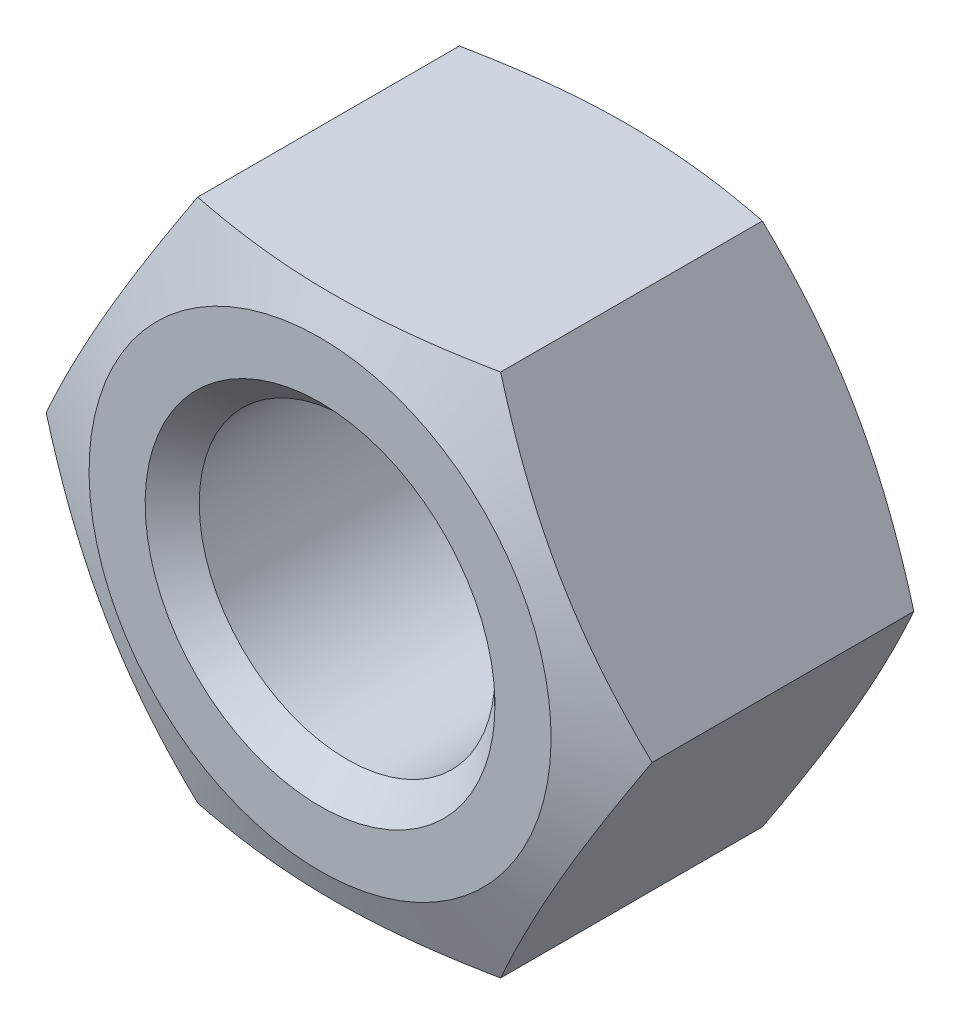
ISO-10303-21;
HEADER;
FILE_DESCRIPTION(('STEP AP214'),'2;1');
FILE_NAME('part.step','',(''),(''),'','','');
FILE_SCHEMA(('AUTOMOTIVE_DESIGN { 1 0 10303 214 1 1 1 1 }'));
ENDSEC;
DATA;
#1=APPLICATION_CONTEXT('core data for automotive mechanical design processes');
#2=APPLICATION_PROTOCOL_DEFINITION('international standard','automotive_design',2000,#1);
#3=PRODUCT_CONTEXT('',#1,'mechanical');
#4=PRODUCT('Part','Part','',(#3));
#5=PRODUCT_RELATED_PRODUCT_CATEGORY('part','',(#4));
#6=PRODUCT_DEFINITION_FORMATION('','',#4);
#7=PRODUCT_DEFINITION_CONTEXT('part definition',#1,'design');
#8=PRODUCT_DEFINITION('design','',#6,#7);
#9=PRODUCT_DEFINITION_SHAPE('','',#8);
#10=(LENGTH_UNIT() NAMED_UNIT(*) SI_UNIT(.MILLI.,.METRE.));
#11=(NAMED_UNIT(*) PLANE_ANGLE_UNIT() SI_UNIT($,.RADIAN.));
#12=(NAMED_UNIT(*) SI_UNIT($,.STERADIAN.) SOLID_ANGLE_UNIT());
#13=UNCERTAINTY_MEASURE_WITH_UNIT(LENGTH_MEASURE(1.E-05),#10,'distance_accuracy_value','');
#14=(GEOMETRIC_REPRESENTATION_CONTEXT(3) GLOBAL_UNCERTAINTY_ASSIGNED_CONTEXT((#13)) GLOBAL_UNIT_ASSIGNED_CONTEXT((#10,
#11,#12)) REPRESENTATION_CONTEXT('',''));
#15=CARTESIAN_POINT('',(0.,0.,0.));
#16=DIRECTION('',(0.,0.,1.));
#17=DIRECTION('',(1.,0.,0.));
#18=AXIS2_PLACEMENT_3D('',#15,#16,#17);
#19=CARTESIAN_POINT('',(12.12435,0.,12.8));
#20=DIRECTION('',(0.,0.,1.));
#21=DIRECTION('',(1.,0.,0.));
#22=AXIS2_PLACEMENT_3D('',#19,#20,#21);
#23=PLANE('',#22);
#24=CARTESIAN_POINT('',(0.,0.,12.8));
#25=DIRECTION('',(0.,0.,-1.));
#26=DIRECTION('',(0.,1.,0.));
#27=AXIS2_PLACEMENT_3D('',#24,#25,#26);
#28=CIRCLE('',#27,7.);
#29=CARTESIAN_POINT('',(0.,7.,12.8));
#30=VERTEX_POINT('',#29);
#31=EDGE_CURVE('E208',#30,#30,#28,.T.);
#32=ORIENTED_EDGE('',*,*,#31,.T.);
#33=EDGE_LOOP('',(#32));
#34=FACE_BOUND('',#33,.T.);
#35=CARTESIAN_POINT('',(0.,0.,12.8));
#36=DIRECTION('',(0.,0.,-1.));
#37=DIRECTION('',(0.,1.,0.));
#38=AXIS2_PLACEMENT_3D('',#35,#36,#37);
#39=CIRCLE('',#38,9.24424893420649);
#40=CARTESIAN_POINT('',(0.,9.24424893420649,12.8));
#41=VERTEX_POINT('',#40);
#42=EDGE_CURVE('E211',#41,#41,#39,.T.);
#43=ORIENTED_EDGE('',*,*,#42,.F.);
#44=EDGE_LOOP('',(#43));
#45=FACE_BOUND('',#44,.T.);
#46=ADVANCED_FACE('F17',(#34,#45),#23,.T.);
#47=CARTESIAN_POINT('',(0.,0.,12.8));
#48=DIRECTION('',(0.,0.,1.));
#49=DIRECTION('',(0.,-1.,0.));
#50=AXIS2_PLACEMENT_3D('',#47,#48,#49);
#51=CONICAL_SURFACE('',#50,7.,0.785398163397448);
#52=CARTESIAN_POINT('',(0.,0.,11.7175));
#53=DIRECTION('',(0.,0.,-1.));
#54=DIRECTION('',(0.,1.,0.));
#55=AXIS2_PLACEMENT_3D('',#52,#53,#54);
#56=CIRCLE('',#55,5.9175);
#57=CARTESIAN_POINT('',(0.,5.9175,11.7175));
#58=VERTEX_POINT('',#57);
#59=EDGE_CURVE('E98',#58,#58,#56,.T.);
#60=ORIENTED_EDGE('',*,*,#59,.T.);
#61=EDGE_LOOP('',(#60));
#62=FACE_BOUND('',#61,.T.);
#63=ORIENTED_EDGE('',*,*,#31,.F.);
#64=EDGE_LOOP('',(#63));
#65=FACE_BOUND('',#64,.T.);
#66=ADVANCED_FACE('F141',(#62,#65),#51,.F.);
#67=CARTESIAN_POINT('',(0.,0.,0.));
#68=DIRECTION('',(0.,0.,-1.));
#69=DIRECTION('',(0.,1.,0.));
#70=AXIS2_PLACEMENT_3D('',#67,#68,#69);
#71=CYLINDRICAL_SURFACE('',#70,5.9175);
#72=CARTESIAN_POINT('',(0.,0.,1.0825));
#73=DIRECTION('',(0.,0.,-1.));
#74=DIRECTION('',(0.,1.,0.));
#75=AXIS2_PLACEMENT_3D('',#72,#73,#74);
#76=CIRCLE('',#75,5.9175);
#77=CARTESIAN_POINT('',(0.,5.9175,1.0825));
#78=VERTEX_POINT('',#77);
#79=EDGE_CURVE('E95',#78,#78,#76,.T.);
#80=ORIENTED_EDGE('',*,*,#79,.T.);
#81=EDGE_LOOP('',(#80));
#82=FACE_BOUND('',#81,.T.);
#83=ORIENTED_EDGE('',*,*,#59,.F.);
#84=EDGE_LOOP('',(#83));
#85=FACE_BOUND('',#84,.T.);
#86=ADVANCED_FACE('F203',(#82,#85),#71,.F.);
#87=CARTESIAN_POINT('',(0.,0.,0.));
#88=DIRECTION('',(0.,0.,-1.));
#89=DIRECTION('',(0.,1.,0.));
#90=AXIS2_PLACEMENT_3D('',#87,#88,#89);
#91=CONICAL_SURFACE('',#90,7.,0.785398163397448);
#92=ORIENTED_EDGE('',*,*,#79,.F.);
#93=EDGE_LOOP('',(#92));
#94=FACE_BOUND('',#93,.T.);
#95=CARTESIAN_POINT('',(0.,0.,0.));
#96=DIRECTION('',(0.,0.,-1.));
#97=DIRECTION('',(0.,1.,0.));
#98=AXIS2_PLACEMENT_3D('',#95,#96,#97);
#99=CIRCLE('',#98,7.);
#100=CARTESIAN_POINT('',(0.,7.,0.));
#101=VERTEX_POINT('',#100);
#102=EDGE_CURVE('E212',#101,#101,#99,.T.);
#103=ORIENTED_EDGE('',*,*,#102,.T.);
#104=EDGE_LOOP('',(#103));
#105=FACE_BOUND('',#104,.T.);
#106=ADVANCED_FACE('F139',(#94,#105),#91,.F.);
#107=CARTESIAN_POINT('',(0.,0.,11.6363636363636));
#108=DIRECTION('',(0.,0.,-1.));
#109=DIRECTION('',(0.,1.,0.));
#110=AXIS2_PLACEMENT_3D('',#107,#108,#109);
#111=CONICAL_SURFACE('',#110,12.12435,1.18682389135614);
#112=ORIENTED_EDGE('',*,*,#42,.T.);
#113=EDGE_LOOP('',(#112));
#114=FACE_BOUND('',#113,.T.);
#115=CARTESIAN_POINT('',(-16.0063107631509,-10.4999951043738,8.80067206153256));
#116=CARTESIAN_POINT('',(-15.5328872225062,-10.4999951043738,8.96056086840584));
#117=CARTESIAN_POINT('',(-15.0588327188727,-10.4999951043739,9.11861596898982));
#118=CARTESIAN_POINT('',(-14.1091353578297,-10.4999951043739,9.43003413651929));
#119=CARTESIAN_POINT('',(-13.6334923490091,-10.4999951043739,9.58339674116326));
#120=CARTESIAN_POINT('',(-12.6792279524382,-10.4999951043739,9.88473867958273));
#121=CARTESIAN_POINT('',(-12.2006021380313,-10.4999951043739,10.0327040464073));
#122=CARTESIAN_POINT('',(-11.2411856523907,-10.4999951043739,10.3214266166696));
#123=CARTESIAN_POINT('',(-10.7603950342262,-10.4999951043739,10.4621839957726));
#124=CARTESIAN_POINT('',(-9.80249199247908,-10.4999951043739,10.7329122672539));
#125=CARTESIAN_POINT('',(-9.32541253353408,-10.4999951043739,10.8629992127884));
#126=CARTESIAN_POINT('',(-8.36834895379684,-10.4999951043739,11.1121522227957));
#127=CARTESIAN_POINT('',(-7.88836474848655,-10.4999951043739,11.2312179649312));
#128=CARTESIAN_POINT('',(-6.92542660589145,-10.4999951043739,11.4554761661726));
#129=CARTESIAN_POINT('',(-6.44247451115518,-10.4999951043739,11.5606764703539));
#130=CARTESIAN_POINT('',(-5.47313887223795,-10.4999951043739,11.7539449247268));
#131=CARTESIAN_POINT('',(-4.98675557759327,-10.4999951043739,11.8420143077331));
#132=CARTESIAN_POINT('',(-4.11049585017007,-10.4999951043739,11.9814373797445));
#133=CARTESIAN_POINT('',(-3.72123116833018,-10.4999951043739,12.0366163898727));
#134=CARTESIAN_POINT('',(-2.94085267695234,-10.4999951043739,12.1319548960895));
#135=CARTESIAN_POINT('',(-2.54973891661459,-10.4999951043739,12.1721147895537));
#136=CARTESIAN_POINT('',(-1.76639711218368,-10.4999951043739,12.235824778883));
#137=CARTESIAN_POINT('',(-1.37416994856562,-10.4999951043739,12.2593855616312));
#138=CARTESIAN_POINT('',(-0.589047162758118,-10.4999951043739,12.2889099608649));
#139=CARTESIAN_POINT('',(-0.196151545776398,-10.4999951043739,12.2948737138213));
#140=CARTESIAN_POINT('',(0.591411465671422,-10.4999951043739,12.2889147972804));
#141=CARTESIAN_POINT('',(0.986078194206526,-10.4999951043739,12.2769050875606));
#142=CARTESIAN_POINT('',(1.77448337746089,-10.4999951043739,12.2353914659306));
#143=CARTESIAN_POINT('',(2.1682218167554,-10.4999951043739,12.2058872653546));
#144=CARTESIAN_POINT('',(2.95437518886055,-10.4999951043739,12.1306214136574));
#145=CARTESIAN_POINT('',(3.34678911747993,-10.4999951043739,12.0848494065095));
#146=CARTESIAN_POINT('',(4.12962212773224,-10.4999951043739,11.9787708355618));
#147=CARTESIAN_POINT('',(4.520041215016,-10.4999951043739,11.9184643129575));
#148=CARTESIAN_POINT('',(5.36415844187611,-10.4999951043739,11.7740177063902));
#149=CARTESIAN_POINT('',(5.81746002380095,-10.4999951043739,11.6875752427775));
#150=CARTESIAN_POINT('',(6.721128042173,-10.4999951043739,11.5004075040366));
#151=CARTESIAN_POINT('',(7.17149410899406,-10.4999951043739,11.3996804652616));
#152=CARTESIAN_POINT('',(8.06966572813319,-10.4999951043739,11.1865330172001));
#153=CARTESIAN_POINT('',(8.51746990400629,-10.4999951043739,11.0741068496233));
#154=CARTESIAN_POINT('',(9.41057046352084,-10.4999951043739,10.8398199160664));
#155=CARTESIAN_POINT('',(9.85586694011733,-10.4999951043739,10.7179595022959));
#156=CARTESIAN_POINT('',(10.7454531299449,-10.4999951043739,10.4662676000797));
#157=CARTESIAN_POINT('',(11.1897371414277,-10.4999951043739,10.3364160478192));
#158=CARTESIAN_POINT('',(12.0764311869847,-10.4999951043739,10.0704757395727));
#159=CARTESIAN_POINT('',(12.5188412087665,-10.4999951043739,9.93438694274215));
#160=CARTESIAN_POINT('',(13.4019390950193,-10.4999951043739,9.65715531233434));
#161=CARTESIAN_POINT('',(13.842627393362,-10.4999951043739,9.51601385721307));
#162=CARTESIAN_POINT('',(14.7226377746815,-10.4999951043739,9.22954759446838));
#163=CARTESIAN_POINT('',(15.1619598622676,-10.4999951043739,9.08422280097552));
#164=CARTESIAN_POINT('',(16.0364398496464,-10.4999951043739,8.79111472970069));
#165=CARTESIAN_POINT('',(16.4716056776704,-10.4999951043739,8.64335506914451));
#166=CARTESIAN_POINT('',(17.3409565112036,-10.4999951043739,8.34497560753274));
#167=CARTESIAN_POINT('',(17.7751415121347,-10.4999951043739,8.1943557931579));
#168=CARTESIAN_POINT('',(19.076499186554,-10.4999951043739,7.73888585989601));
#169=CARTESIAN_POINT('',(19.9424151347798,-10.4999951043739,7.43044530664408));
#170=CARTESIAN_POINT('',(21.6660361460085,-10.4999951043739,6.80872419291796));
#171=CARTESIAN_POINT('',(22.5237576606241,-10.4999951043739,6.49548907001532));
#172=CARTESIAN_POINT('',(23.8088748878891,-10.4999951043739,6.02183516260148));
#173=CARTESIAN_POINT('',(24.2369762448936,-10.4999951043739,5.86332707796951));
#174=CARTESIAN_POINT('',(25.0927618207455,-10.4999951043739,5.54519336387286));
#175=CARTESIAN_POINT('',(25.520446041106,-10.4999951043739,5.38556773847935));
#176=CARTESIAN_POINT('',(25.9479498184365,-10.4999951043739,5.22546067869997));
#177=B_SPLINE_CURVE_WITH_KNOTS('',3,(#115,#116,#117,#118,#119,#120,#121,#122,#123,#124,#125,
#126,#127,#128,#129,#130,#131,#132,#133,#134,#135,#136,#137,#138,#139,#140,#141,#142,#143,#144,
#145,#146,#147,#148,#149,#150,#151,#152,#153,#154,#155,#156,#157,#158,#159,#160,#161,#162,#163,
#164,#165,#166,#167,#168,#169,#170,#171,#172,#173,#174,#175,#176),.UNSPECIFIED.,.F.,.F.,(4,2,2,
2,2,2,2,2,2,2,2,2,2,2,2,2,2,2,2,2,2,2,2,2,2,2,2,2,2,2,4),(0.,1.49909536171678,2.99833794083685,
4.50121878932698,6.00406299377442,7.48745093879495,8.97088225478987,10.4534706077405,
11.9359522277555,13.1151689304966,14.2943544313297,15.4727800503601,16.6511965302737,
17.8353382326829,19.0194994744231,20.2044159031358,21.3893289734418,22.7734513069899,
24.1577446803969,25.5427226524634,26.927648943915,28.3162067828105,29.7047737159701,
31.0929646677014,32.481150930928,33.8598413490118,35.2385381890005,37.9961199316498,
40.7354837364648,42.1049933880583,43.474498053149),.UNSPECIFIED.);
#178=CARTESIAN_POINT('',(-6.062175,-10.4999951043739,11.6363636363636));
#179=VERTEX_POINT('',#178);
#180=CARTESIAN_POINT('',(6.062175,-10.4999951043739,11.6363636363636));
#181=VERTEX_POINT('',#180);
#182=EDGE_CURVE('E78',#179,#181,#177,.T.);
#183=ORIENTED_EDGE('',*,*,#182,.T.);
#184=CARTESIAN_POINT('',(6.06217488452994,-10.4999953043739,11.6363635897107));
#185=CARTESIAN_POINT('',(6.2739709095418,-10.1331538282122,11.7219396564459));
#186=CARTESIAN_POINT('',(6.48646598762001,-9.76510155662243,11.8010684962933));
#187=CARTESIAN_POINT('',(6.91286124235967,-9.02656331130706,11.943999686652));
#188=CARTESIAN_POINT('',(7.12676216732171,-8.65607604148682,12.0077930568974));
#189=CARTESIAN_POINT('',(7.55566465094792,-7.91319514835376,12.1174992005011));
#190=CARTESIAN_POINT('',(7.77066586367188,-7.54080212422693,12.1634172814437));
#191=CARTESIAN_POINT('',(8.20146693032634,-6.79463278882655,12.2352449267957));
#192=CARTESIAN_POINT('',(8.41726659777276,-6.42085680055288,12.2611588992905));
#193=CARTESIAN_POINT('',(8.84558069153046,-5.67899502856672,12.2913668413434));
#194=CARTESIAN_POINT('',(9.05808868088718,-5.31092039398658,12.2960204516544));
#195=CARTESIAN_POINT('',(9.48297907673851,-4.57498864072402,12.2844353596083));
#196=CARTESIAN_POINT('',(9.6953614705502,-4.20713154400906,12.2681948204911));
#197=CARTESIAN_POINT('',(10.1193592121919,-3.47274591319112,12.2156944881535));
#198=CARTESIAN_POINT('',(10.3309749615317,-3.10621668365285,12.1794474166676));
#199=CARTESIAN_POINT('',(10.7531961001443,-2.37490821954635,12.088690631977));
#200=CARTESIAN_POINT('',(10.9638015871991,-2.01012881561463,12.0341827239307));
#201=CARTESIAN_POINT('',(11.2532321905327,-1.5088203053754,11.9480214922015));
#202=CARTESIAN_POINT('',(11.3325846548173,-1.37137780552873,11.9232270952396));
#203=CARTESIAN_POINT('',(11.4911022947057,-1.0968171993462,11.8714792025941));
#204=CARTESIAN_POINT('',(11.5702674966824,-0.959699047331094,11.8445260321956));
#205=CARTESIAN_POINT('',(11.7286881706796,-0.685306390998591,11.788489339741));
#206=CARTESIAN_POINT('',(11.8079430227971,-0.548032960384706,11.7593988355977));
#207=CARTESIAN_POINT('',(11.9662790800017,-0.273786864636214,11.6992927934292));
#208=CARTESIAN_POINT('',(12.0453602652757,-0.136814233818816,11.6682770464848));
#209=CARTESIAN_POINT('',(12.12435011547,1.99999999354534E-07,11.6363635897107));
#210=B_SPLINE_CURVE_WITH_KNOTS('',3,(#184,#185,#186,#187,#188,#189,#190,#191,#192,#193,#194,
#195,#196,#197,#198,#199,#200,#201,#202,#203,#204,#205,#206,#207,#208,#209),.UNSPECIFIED.,.F.,
.F.,(4,2,2,2,2,2,2,2,2,2,2,2,4),(0.,1.29654028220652,2.59383796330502,3.89075015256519,
5.18737647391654,6.46198579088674,7.7367071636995,9.01061890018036,10.2844047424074,
10.766285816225,11.2480944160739,11.7315536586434,12.2150654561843),.UNSPECIFIED.);
#211=CARTESIAN_POINT('',(12.12435,0.,11.6363636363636));
#212=VERTEX_POINT('',#211);
#213=EDGE_CURVE('E163',#181,#212,#210,.T.);
#214=ORIENTED_EDGE('',*,*,#213,.T.);
#215=CARTESIAN_POINT('',(12.12435011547,-1.99999999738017E-07,11.6363635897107));
#216=CARTESIAN_POINT('',(11.9125540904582,0.366841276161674,11.7219396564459));
#217=CARTESIAN_POINT('',(11.70005901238,0.734893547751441,11.8010684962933));
#218=CARTESIAN_POINT('',(11.2736637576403,1.47343179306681,11.943999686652));
#219=CARTESIAN_POINT('',(11.0597628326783,1.84391906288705,12.0077930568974));
#220=CARTESIAN_POINT('',(10.6308603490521,2.58679995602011,12.1174992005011));
#221=CARTESIAN_POINT('',(10.4158591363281,2.95919298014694,12.1634172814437));
#222=CARTESIAN_POINT('',(9.98505806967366,3.70536231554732,12.2352449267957));
#223=CARTESIAN_POINT('',(9.76925840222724,4.07913830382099,12.2611588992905));
#224=CARTESIAN_POINT('',(9.34094430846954,4.82100007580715,12.2913668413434));
#225=CARTESIAN_POINT('',(9.12843631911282,5.18907471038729,12.2960204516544));
#226=CARTESIAN_POINT('',(8.70354592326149,5.92500646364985,12.2844353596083));
#227=CARTESIAN_POINT('',(8.49116352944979,6.29286356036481,12.2681948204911));
#228=CARTESIAN_POINT('',(8.06716578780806,7.02724919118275,12.2156944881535));
#229=CARTESIAN_POINT('',(7.85555003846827,7.39377842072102,12.1794474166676));
#230=CARTESIAN_POINT('',(7.43332889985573,8.12508688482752,12.088690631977));
#231=CARTESIAN_POINT('',(7.22272341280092,8.48986628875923,12.0341827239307));
#232=CARTESIAN_POINT('',(6.93329280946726,8.99117479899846,11.9480214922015));
#233=CARTESIAN_POINT('',(6.85394034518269,9.12861729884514,11.9232270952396));
#234=CARTESIAN_POINT('',(6.69542270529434,9.40317790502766,11.8714792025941));
#235=CARTESIAN_POINT('',(6.61625750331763,9.54029605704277,11.8445260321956));
#236=CARTESIAN_POINT('',(6.4578368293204,9.81468871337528,11.788489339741));
#237=CARTESIAN_POINT('',(6.37858197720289,9.95196214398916,11.7593988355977));
#238=CARTESIAN_POINT('',(6.2202459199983,10.2262082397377,11.6992927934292));
#239=CARTESIAN_POINT('',(6.14116473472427,10.3631808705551,11.6682770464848));
#240=CARTESIAN_POINT('',(6.06217488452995,10.4999953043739,11.6363635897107));
#241=B_SPLINE_CURVE_WITH_KNOTS('',3,(#215,#216,#217,#218,#219,#220,#221,#222,#223,#224,#225,
#226,#227,#228,#229,#230,#231,#232,#233,#234,#235,#236,#237,#238,#239,#240),.UNSPECIFIED.,.F.,
.F.,(4,2,2,2,2,2,2,2,2,2,2,2,4),(0.,1.29654028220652,2.59383796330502,3.89075015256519,
5.18737647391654,6.46198579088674,7.7367071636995,9.01061890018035,10.2844047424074,
10.766285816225,11.2480944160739,11.7315536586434,12.2150654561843),.UNSPECIFIED.);
#242=CARTESIAN_POINT('',(6.062175,10.4999951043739,11.6363636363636));
#243=VERTEX_POINT('',#242);
#244=EDGE_CURVE('E40',#212,#243,#241,.T.);
#245=ORIENTED_EDGE('',*,*,#244,.T.);
#246=CARTESIAN_POINT('',(-16.0063107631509,10.4999951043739,8.80067206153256));
#247=CARTESIAN_POINT('',(-15.5328872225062,10.4999951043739,8.96056086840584));
#248=CARTESIAN_POINT('',(-15.0588327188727,10.4999951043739,9.11861596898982));
#249=CARTESIAN_POINT('',(-14.1091353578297,10.4999951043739,9.43003413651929));
#250=CARTESIAN_POINT('',(-13.6334923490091,10.4999951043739,9.58339674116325));
#251=CARTESIAN_POINT('',(-12.6792279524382,10.4999951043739,9.88473867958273));
#252=CARTESIAN_POINT('',(-12.2006021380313,10.4999951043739,10.0327040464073));
#253=CARTESIAN_POINT('',(-11.2411856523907,10.4999951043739,10.3214266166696));
#254=CARTESIAN_POINT('',(-10.7603950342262,10.4999951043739,10.4621839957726));
#255=CARTESIAN_POINT('',(-9.80249199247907,10.4999951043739,10.7329122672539));
#256=CARTESIAN_POINT('',(-9.32541253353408,10.4999951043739,10.8629992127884));
#257=CARTESIAN_POINT('',(-8.36834895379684,10.4999951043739,11.1121522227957));
#258=CARTESIAN_POINT('',(-7.88836474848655,10.4999951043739,11.2312179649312));
#259=CARTESIAN_POINT('',(-6.92542660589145,10.4999951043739,11.4554761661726));
#260=CARTESIAN_POINT('',(-6.44247451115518,10.4999951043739,11.5606764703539));
#261=CARTESIAN_POINT('',(-5.47313887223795,10.4999951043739,11.7539449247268));
#262=CARTESIAN_POINT('',(-4.98675557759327,10.4999951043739,11.8420143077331));
#263=CARTESIAN_POINT('',(-4.11049585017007,10.4999951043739,11.9814373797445));
#264=CARTESIAN_POINT('',(-3.72123116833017,10.4999951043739,12.0366163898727));
#265=CARTESIAN_POINT('',(-2.94085267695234,10.4999951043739,12.1319548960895));
#266=CARTESIAN_POINT('',(-2.54973891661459,10.4999951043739,12.1721147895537));
#267=CARTESIAN_POINT('',(-1.76639711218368,10.4999951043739,12.235824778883));
#268=CARTESIAN_POINT('',(-1.37416994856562,10.4999951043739,12.2593855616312));
#269=CARTESIAN_POINT('',(-0.589047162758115,10.4999951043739,12.2889099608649));
#270=CARTESIAN_POINT('',(-0.196151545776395,10.4999951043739,12.2948737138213));
#271=CARTESIAN_POINT('',(0.591411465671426,10.4999951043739,12.2889147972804));
#272=CARTESIAN_POINT('',(0.986078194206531,10.4999951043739,12.2769050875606));
#273=CARTESIAN_POINT('',(1.7744833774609,10.4999951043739,12.2353914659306));
#274=CARTESIAN_POINT('',(2.1682218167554,10.4999951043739,12.2058872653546));
#275=CARTESIAN_POINT('',(2.95437518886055,10.4999951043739,12.1306214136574));
#276=CARTESIAN_POINT('',(3.34678911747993,10.4999951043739,12.0848494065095));
#277=CARTESIAN_POINT('',(4.12962212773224,10.4999951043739,11.9787708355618));
#278=CARTESIAN_POINT('',(4.520041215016,10.4999951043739,11.9184643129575));
#279=CARTESIAN_POINT('',(5.36415844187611,10.4999951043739,11.7740177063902));
#280=CARTESIAN_POINT('',(5.81746002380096,10.4999951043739,11.6875752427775));
#281=CARTESIAN_POINT('',(6.721128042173,10.4999951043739,11.5004075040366));
#282=CARTESIAN_POINT('',(7.17149410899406,10.4999951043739,11.3996804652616));
#283=CARTESIAN_POINT('',(8.06966572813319,10.4999951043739,11.1865330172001));
#284=CARTESIAN_POINT('',(8.51746990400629,10.4999951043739,11.0741068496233));
#285=CARTESIAN_POINT('',(9.41057046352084,10.4999951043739,10.8398199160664));
#286=CARTESIAN_POINT('',(9.85586694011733,10.4999951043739,10.7179595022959));
#287=CARTESIAN_POINT('',(10.7454531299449,10.4999951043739,10.4662676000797));
#288=CARTESIAN_POINT('',(11.1897371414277,10.4999951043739,10.3364160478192));
#289=CARTESIAN_POINT('',(12.0764311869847,10.4999951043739,10.0704757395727));
#290=CARTESIAN_POINT('',(12.5188412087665,10.4999951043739,9.93438694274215));
#291=CARTESIAN_POINT('',(13.4019390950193,10.4999951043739,9.65715531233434));
#292=CARTESIAN_POINT('',(13.842627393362,10.4999951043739,9.51601385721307));
#293=CARTESIAN_POINT('',(14.7226377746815,10.4999951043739,9.22954759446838));
#294=CARTESIAN_POINT('',(15.1619598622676,10.4999951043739,9.08422280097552));
#295=CARTESIAN_POINT('',(16.0364398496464,10.4999951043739,8.7911147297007));
#296=CARTESIAN_POINT('',(16.4716056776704,10.4999951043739,8.64335506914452));
#297=CARTESIAN_POINT('',(17.3409565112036,10.4999951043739,8.34497560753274));
#298=CARTESIAN_POINT('',(17.7751415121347,10.4999951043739,8.1943557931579));
#299=CARTESIAN_POINT('',(19.076499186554,10.4999951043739,7.73888585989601));
#300=CARTESIAN_POINT('',(19.9424151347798,10.4999951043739,7.43044530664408));
#301=CARTESIAN_POINT('',(21.6660361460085,10.4999951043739,6.80872419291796));
#302=CARTESIAN_POINT('',(22.5237576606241,10.4999951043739,6.49548907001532));
#303=CARTESIAN_POINT('',(23.8088748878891,10.4999951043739,6.02183516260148));
#304=CARTESIAN_POINT('',(24.2369762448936,10.4999951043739,5.86332707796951));
#305=CARTESIAN_POINT('',(25.0927618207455,10.4999951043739,5.54519336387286));
#306=CARTESIAN_POINT('',(25.520446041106,10.4999951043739,5.38556773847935));
#307=CARTESIAN_POINT('',(25.9479498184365,10.4999951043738,5.22546067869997));
#308=B_SPLINE_CURVE_WITH_KNOTS('',3,(#246,#247,#248,#249,#250,#251,#252,#253,#254,#255,#256,
#257,#258,#259,#260,#261,#262,#263,#264,#265,#266,#267,#268,#269,#270,#271,#272,#273,#274,#275,
#276,#277,#278,#279,#280,#281,#282,#283,#284,#285,#286,#287,#288,#289,#290,#291,#292,#293,#294,
#295,#296,#297,#298,#299,#300,#301,#302,#303,#304,#305,#306,#307),.UNSPECIFIED.,.F.,.F.,(4,2,2,
2,2,2,2,2,2,2,2,2,2,2,2,2,2,2,2,2,2,2,2,2,2,2,2,2,2,2,4),(0.,1.49909536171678,2.99833794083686,
4.50121878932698,6.00406299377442,7.48745093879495,8.97088225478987,10.4534706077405,
11.9359522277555,13.1151689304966,14.2943544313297,15.4727800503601,16.6511965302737,
17.8353382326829,19.0194994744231,20.2044159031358,21.3893289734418,22.7734513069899,
24.1577446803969,25.5427226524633,26.927648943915,28.3162067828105,29.7047737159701,
31.0929646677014,32.481150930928,33.8598413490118,35.2385381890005,37.9961199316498,
40.7354837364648,42.1049933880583,43.474498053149),.UNSPECIFIED.);
#309=CARTESIAN_POINT('',(-6.062175,10.4999951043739,11.6363636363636));
#310=VERTEX_POINT('',#309);
#311=EDGE_CURVE('E154',#243,#310,#308,.F.);
#312=ORIENTED_EDGE('',*,*,#311,.T.);
#313=CARTESIAN_POINT('',(-6.06217488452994,10.4999953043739,11.6363635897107));
#314=CARTESIAN_POINT('',(-6.2739709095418,10.1331538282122,11.7219396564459));
#315=CARTESIAN_POINT('',(-6.48646598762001,9.76510155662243,11.8010684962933));
#316=CARTESIAN_POINT('',(-6.91286124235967,9.02656331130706,11.943999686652));
#317=CARTESIAN_POINT('',(-7.12676216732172,8.65607604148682,12.0077930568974));
#318=CARTESIAN_POINT('',(-7.55566465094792,7.91319514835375,12.1174992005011));
#319=CARTESIAN_POINT('',(-7.77066586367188,7.54080212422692,12.1634172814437));
#320=CARTESIAN_POINT('',(-8.20146693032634,6.79463278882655,12.2352449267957));
#321=CARTESIAN_POINT('',(-8.41726659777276,6.42085680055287,12.2611588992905));
#322=CARTESIAN_POINT('',(-8.84558069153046,5.67899502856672,12.2913668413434));
#323=CARTESIAN_POINT('',(-9.05808868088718,5.31092039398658,12.2960204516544));
#324=CARTESIAN_POINT('',(-9.48297907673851,4.57498864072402,12.2844353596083));
#325=CARTESIAN_POINT('',(-9.6953614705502,4.20713154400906,12.2681948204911));
#326=CARTESIAN_POINT('',(-10.1193592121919,3.47274591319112,12.2156944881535));
#327=CARTESIAN_POINT('',(-10.3309749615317,3.10621668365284,12.1794474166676));
#328=CARTESIAN_POINT('',(-10.7531961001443,2.37490821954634,12.088690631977));
#329=CARTESIAN_POINT('',(-10.9638015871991,2.01012881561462,12.0341827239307));
#330=CARTESIAN_POINT('',(-11.2532321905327,1.5088203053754,11.9480214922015));
#331=CARTESIAN_POINT('',(-11.3325846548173,1.37137780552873,11.9232270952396));
#332=CARTESIAN_POINT('',(-11.4911022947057,1.0968171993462,11.8714792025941));
#333=CARTESIAN_POINT('',(-11.5702674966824,0.959699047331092,11.8445260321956));
#334=CARTESIAN_POINT('',(-11.7286881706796,0.68530639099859,11.788489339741));
#335=CARTESIAN_POINT('',(-11.8079430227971,0.548032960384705,11.7593988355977));
#336=CARTESIAN_POINT('',(-11.9662790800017,0.273786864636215,11.6992927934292));
#337=CARTESIAN_POINT('',(-12.0453602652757,0.136814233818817,11.6682770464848));
#338=CARTESIAN_POINT('',(-12.12435011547,-1.99999997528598E-07,11.6363635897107));
#339=B_SPLINE_CURVE_WITH_KNOTS('',3,(#313,#314,#315,#316,#317,#318,#319,#320,#321,#322,#323,
#324,#325,#326,#327,#328,#329,#330,#331,#332,#333,#334,#335,#336,#337,#338),.UNSPECIFIED.,.F.,
.F.,(4,2,2,2,2,2,2,2,2,2,2,2,4),(0.,1.29654028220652,2.59383796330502,3.89075015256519,
5.18737647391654,6.46198579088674,7.73670716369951,9.01061890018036,10.2844047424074,
10.766285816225,11.2480944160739,11.7315536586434,12.2150654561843),.UNSPECIFIED.);
#340=CARTESIAN_POINT('',(-12.12435,0.,11.6363636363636));
#341=VERTEX_POINT('',#340);
#342=EDGE_CURVE('E149',#310,#341,#339,.T.);
#343=ORIENTED_EDGE('',*,*,#342,.T.);
#344=CARTESIAN_POINT('',(-12.12435011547,2.0000000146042E-07,11.6363635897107));
#345=CARTESIAN_POINT('',(-11.9125540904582,-0.366841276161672,11.7219396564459));
#346=CARTESIAN_POINT('',(-11.70005901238,-0.73489354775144,11.8010684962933));
#347=CARTESIAN_POINT('',(-11.2736637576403,-1.47343179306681,11.943999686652));
#348=CARTESIAN_POINT('',(-11.0597628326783,-1.84391906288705,12.0077930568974));
#349=CARTESIAN_POINT('',(-10.6308603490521,-2.58679995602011,12.1174992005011));
#350=CARTESIAN_POINT('',(-10.4158591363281,-2.95919298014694,12.1634172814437));
#351=CARTESIAN_POINT('',(-9.98505806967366,-3.70536231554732,12.2352449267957));
#352=CARTESIAN_POINT('',(-9.76925840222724,-4.07913830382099,12.2611588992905));
#353=CARTESIAN_POINT('',(-9.34094430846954,-4.82100007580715,12.2913668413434));
#354=CARTESIAN_POINT('',(-9.12843631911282,-5.18907471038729,12.2960204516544));
#355=CARTESIAN_POINT('',(-8.70354592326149,-5.92500646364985,12.2844353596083));
#356=CARTESIAN_POINT('',(-8.4911635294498,-6.2928635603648,12.2681948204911));
#357=CARTESIAN_POINT('',(-8.06716578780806,-7.02724919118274,12.2156944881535));
#358=CARTESIAN_POINT('',(-7.85555003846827,-7.39377842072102,12.1794474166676));
#359=CARTESIAN_POINT('',(-7.43332889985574,-8.12508688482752,12.088690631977));
#360=CARTESIAN_POINT('',(-7.22272341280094,-8.48986628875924,12.0341827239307));
#361=CARTESIAN_POINT('',(-6.93329280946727,-8.99117479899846,11.9480214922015));
#362=CARTESIAN_POINT('',(-6.85394034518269,-9.12861729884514,11.9232270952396));
#363=CARTESIAN_POINT('',(-6.69542270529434,-9.40317790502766,11.8714792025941));
#364=CARTESIAN_POINT('',(-6.61625750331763,-9.54029605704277,11.8445260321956));
#365=CARTESIAN_POINT('',(-6.4578368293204,-9.81468871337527,11.788489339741));
#366=CARTESIAN_POINT('',(-6.37858197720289,-9.95196214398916,11.7593988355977));
#367=CARTESIAN_POINT('',(-6.2202459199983,-10.2262082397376,11.6992927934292));
#368=CARTESIAN_POINT('',(-6.14116473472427,-10.363180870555,11.6682770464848));
#369=CARTESIAN_POINT('',(-6.06217488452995,-10.4999953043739,11.6363635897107));
#370=B_SPLINE_CURVE_WITH_KNOTS('',3,(#344,#345,#346,#347,#348,#349,#350,#351,#352,#353,#354,
#355,#356,#357,#358,#359,#360,#361,#362,#363,#364,#365,#366,#367,#368,#369),.UNSPECIFIED.,.F.,
.F.,(4,2,2,2,2,2,2,2,2,2,2,2,4),(0.,1.29654028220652,2.59383796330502,3.89075015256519,
5.18737647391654,6.46198579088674,7.7367071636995,9.01061890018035,10.2844047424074,
10.766285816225,11.2480944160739,11.7315536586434,12.2150654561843),.UNSPECIFIED.);
#371=EDGE_CURVE('E126',#341,#179,#370,.T.);
#372=ORIENTED_EDGE('',*,*,#371,.T.);
#373=EDGE_LOOP('',(#183,#214,#245,#312,#343,#372));
#374=FACE_BOUND('',#373,.T.);
#375=ADVANCED_FACE('F135',(#114,#374),#111,.T.);
#376=CARTESIAN_POINT('',(6.062175,-10.4999951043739,12.8));
#377=DIRECTION('',(-0.866025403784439,0.5,0.));
#378=DIRECTION('',(-0.5,-0.866025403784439,0.));
#379=AXIS2_PLACEMENT_3D('',#376,#377,#378);
#380=PLANE('',#379);
#381=ORIENTED_EDGE('',*,*,#213,.F.);
#382=DIRECTION('',(0.,0.,-1.));
#383=VECTOR('',#382,1.);
#384=CARTESIAN_POINT('',(6.062175,-10.4999951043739,12.8));
#385=LINE('',#384,#383);
#386=CARTESIAN_POINT('',(6.062175,-10.4999951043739,1.16363636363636));
#387=VERTEX_POINT('',#386);
#388=EDGE_CURVE('E82',#181,#387,#385,.T.);
#389=ORIENTED_EDGE('',*,*,#388,.T.);
#390=CARTESIAN_POINT('',(12.1243501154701,2.E-07,1.16363641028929));
#391=CARTESIAN_POINT('',(11.9125540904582,-0.366841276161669,1.07806034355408));
#392=CARTESIAN_POINT('',(11.70005901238,-0.734893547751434,0.998931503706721));
#393=CARTESIAN_POINT('',(11.2736637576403,-1.4734317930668,0.856000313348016));
#394=CARTESIAN_POINT('',(11.0597628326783,-1.84391906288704,0.792206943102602));
#395=CARTESIAN_POINT('',(10.6308603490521,-2.58679995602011,0.682500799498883));
#396=CARTESIAN_POINT('',(10.4158591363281,-2.95919298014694,0.636582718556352));
#397=CARTESIAN_POINT('',(9.98505806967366,-3.70536231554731,0.56475507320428));
#398=CARTESIAN_POINT('',(9.76925840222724,-4.07913830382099,0.538841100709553));
#399=CARTESIAN_POINT('',(9.34094430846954,-4.82100007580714,0.50863315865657));
#400=CARTESIAN_POINT('',(9.12843631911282,-5.18907471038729,0.503979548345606));
#401=CARTESIAN_POINT('',(8.70354592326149,-5.92500646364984,0.51556464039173));
#402=CARTESIAN_POINT('',(8.4911635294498,-6.2928635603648,0.531805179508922));
#403=CARTESIAN_POINT('',(8.06716578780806,-7.02724919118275,0.584305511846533));
#404=CARTESIAN_POINT('',(7.85555003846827,-7.39377842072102,0.620552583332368));
#405=CARTESIAN_POINT('',(7.43332889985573,-8.12508688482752,0.711309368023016));
#406=CARTESIAN_POINT('',(7.22272341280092,-8.48986628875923,0.765817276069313));
#407=CARTESIAN_POINT('',(6.93329280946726,-8.99117479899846,0.851978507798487));
#408=CARTESIAN_POINT('',(6.85394034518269,-9.12861729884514,0.876772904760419));
#409=CARTESIAN_POINT('',(6.69542270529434,-9.40317790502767,0.928520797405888));
#410=CARTESIAN_POINT('',(6.61625750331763,-9.54029605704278,0.955473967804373));
#411=CARTESIAN_POINT('',(6.4578368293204,-9.81468871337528,1.01151066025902));
#412=CARTESIAN_POINT('',(6.37858197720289,-9.95196214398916,1.04060116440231));
#413=CARTESIAN_POINT('',(6.2202459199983,-10.2262082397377,1.10070720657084));
#414=CARTESIAN_POINT('',(6.14116473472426,-10.3631808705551,1.13172295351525));
#415=CARTESIAN_POINT('',(6.06217488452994,-10.4999953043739,1.1636364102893));
#416=B_SPLINE_CURVE_WITH_KNOTS('',3,(#390,#391,#392,#393,#394,#395,#396,#397,#398,#399,#400,
#401,#402,#403,#404,#405,#406,#407,#408,#409,#410,#411,#412,#413,#414,#415),.UNSPECIFIED.,.F.,
.F.,(4,2,2,2,2,2,2,2,2,2,2,2,4),(0.,1.29654028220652,2.59383796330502,3.89075015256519,
5.18737647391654,6.46198579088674,7.73670716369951,9.01061890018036,10.2844047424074,
10.766285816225,11.2480944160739,11.7315536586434,12.2150654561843),.UNSPECIFIED.);
#417=CARTESIAN_POINT('',(12.12435,0.,1.16363636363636));
#418=VERTEX_POINT('',#417);
#419=EDGE_CURVE('E33',#418,#387,#416,.T.);
#420=ORIENTED_EDGE('',*,*,#419,.F.);
#421=DIRECTION('',(0.,0.,-1.));
#422=VECTOR('',#421,1.);
#423=CARTESIAN_POINT('',(12.12435,0.,12.8));
#424=LINE('',#423,#422);
#425=EDGE_CURVE('E26',#212,#418,#424,.T.);
#426=ORIENTED_EDGE('',*,*,#425,.F.);
#427=EDGE_LOOP('',(#381,#389,#420,#426));
#428=FACE_BOUND('',#427,.T.);
#429=ADVANCED_FACE('F19',(#428),#380,.F.);
#430=CARTESIAN_POINT('',(12.12435,0.,12.8));
#431=DIRECTION('',(-0.866025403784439,-0.5,0.));
#432=DIRECTION('',(0.5,-0.866025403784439,0.));
#433=AXIS2_PLACEMENT_3D('',#430,#431,#432);
#434=PLANE('',#433);
#435=ORIENTED_EDGE('',*,*,#244,.F.);
#436=ORIENTED_EDGE('',*,*,#425,.T.);
#437=CARTESIAN_POINT('',(6.06217488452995,10.4999953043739,1.16363641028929));
#438=CARTESIAN_POINT('',(6.27397090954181,10.1331538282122,1.07806034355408));
#439=CARTESIAN_POINT('',(6.48646598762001,9.76510155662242,0.99893150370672));
#440=CARTESIAN_POINT('',(6.91286124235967,9.02656331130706,0.856000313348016));
#441=CARTESIAN_POINT('',(7.12676216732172,8.65607604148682,0.792206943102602));
#442=CARTESIAN_POINT('',(7.55566465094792,7.91319514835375,0.682500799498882));
#443=CARTESIAN_POINT('',(7.77066586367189,7.54080212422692,0.636582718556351));
#444=CARTESIAN_POINT('',(8.20146693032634,6.79463278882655,0.56475507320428));
#445=CARTESIAN_POINT('',(8.41726659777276,6.42085680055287,0.538841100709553));
#446=CARTESIAN_POINT('',(8.84558069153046,5.67899502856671,0.50863315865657));
#447=CARTESIAN_POINT('',(9.05808868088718,5.31092039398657,0.503979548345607));
#448=CARTESIAN_POINT('',(9.48297907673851,4.57498864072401,0.51556464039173));
#449=CARTESIAN_POINT('',(9.69536147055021,4.20713154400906,0.531805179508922));
#450=CARTESIAN_POINT('',(10.1193592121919,3.47274591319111,0.584305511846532));
#451=CARTESIAN_POINT('',(10.3309749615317,3.10621668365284,0.620552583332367));
#452=CARTESIAN_POINT('',(10.7531961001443,2.37490821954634,0.711309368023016));
#453=CARTESIAN_POINT('',(10.9638015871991,2.01012881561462,0.765817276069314));
#454=CARTESIAN_POINT('',(11.2532321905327,1.5088203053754,0.851978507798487));
#455=CARTESIAN_POINT('',(11.3325846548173,1.37137780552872,0.876772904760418));
#456=CARTESIAN_POINT('',(11.4911022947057,1.0968171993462,0.928520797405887));
#457=CARTESIAN_POINT('',(11.5702674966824,0.959699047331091,0.955473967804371));
#458=CARTESIAN_POINT('',(11.7286881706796,0.685306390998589,1.01151066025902));
#459=CARTESIAN_POINT('',(11.8079430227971,0.548032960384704,1.04060116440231));
#460=CARTESIAN_POINT('',(11.9662790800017,0.273786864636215,1.10070720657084));
#461=CARTESIAN_POINT('',(12.0453602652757,0.136814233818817,1.13172295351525));
#462=CARTESIAN_POINT('',(12.12435011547,-1.99999999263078E-07,1.16363641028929));
#463=B_SPLINE_CURVE_WITH_KNOTS('',3,(#437,#438,#439,#440,#441,#442,#443,#444,#445,#446,#447,
#448,#449,#450,#451,#452,#453,#454,#455,#456,#457,#458,#459,#460,#461,#462),.UNSPECIFIED.,.F.,
.F.,(4,2,2,2,2,2,2,2,2,2,2,2,4),(0.,1.29654028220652,2.59383796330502,3.89075015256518,
5.18737647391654,6.46198579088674,7.73670716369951,9.01061890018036,10.2844047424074,
10.766285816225,11.2480944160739,11.7315536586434,12.2150654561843),.UNSPECIFIED.);
#464=CARTESIAN_POINT('',(6.062175,10.4999951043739,1.16363636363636));
#465=VERTEX_POINT('',#464);
#466=EDGE_CURVE('E174',#465,#418,#463,.T.);
#467=ORIENTED_EDGE('',*,*,#466,.F.);
#468=DIRECTION('',(0.,0.,-1.));
#469=VECTOR('',#468,1.);
#470=CARTESIAN_POINT('',(6.062175,10.4999951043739,12.8));
#471=LINE('',#470,#469);
#472=EDGE_CURVE('E416',#243,#465,#471,.T.);
#473=ORIENTED_EDGE('',*,*,#472,.F.);
#474=EDGE_LOOP('',(#435,#436,#467,#473));
#475=FACE_BOUND('',#474,.T.);
#476=ADVANCED_FACE('F168',(#475),#434,.F.);
#477=CARTESIAN_POINT('',(6.062175,10.4999951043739,12.8));
#478=DIRECTION('',(0.,-1.,0.));
#479=DIRECTION('',(1.,0.,0.));
#480=AXIS2_PLACEMENT_3D('',#477,#478,#479);
#481=PLANE('',#480);
#482=ORIENTED_EDGE('',*,*,#311,.F.);
#483=ORIENTED_EDGE('',*,*,#472,.T.);
#484=CARTESIAN_POINT('',(-16.0063107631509,10.4999951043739,3.99932793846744));
#485=CARTESIAN_POINT('',(-15.5328872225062,10.4999951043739,3.83943913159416));
#486=CARTESIAN_POINT('',(-15.0588327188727,10.4999951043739,3.68138403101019));
#487=CARTESIAN_POINT('',(-14.1091353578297,10.4999951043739,3.36996586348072));
#488=CARTESIAN_POINT('',(-13.6334923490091,10.4999951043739,3.21660325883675));
#489=CARTESIAN_POINT('',(-12.6792279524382,10.4999951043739,2.91526132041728));
#490=CARTESIAN_POINT('',(-12.2006021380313,10.4999951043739,2.76729595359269));
#491=CARTESIAN_POINT('',(-11.2411856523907,10.4999951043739,2.47857338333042));
#492=CARTESIAN_POINT('',(-10.7603950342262,10.4999951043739,2.33781600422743));
#493=CARTESIAN_POINT('',(-9.80249199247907,10.4999951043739,2.06708773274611));
#494=CARTESIAN_POINT('',(-9.32541253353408,10.4999951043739,1.93700078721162));
#495=CARTESIAN_POINT('',(-8.36834895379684,10.4999951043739,1.68784777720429));
#496=CARTESIAN_POINT('',(-7.88836474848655,10.4999951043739,1.56878203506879));
#497=CARTESIAN_POINT('',(-6.92542660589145,10.4999951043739,1.34452383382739));
#498=CARTESIAN_POINT('',(-6.44247451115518,10.4999951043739,1.23932352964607));
#499=CARTESIAN_POINT('',(-5.47313887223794,10.4999951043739,1.04605507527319));
#500=CARTESIAN_POINT('',(-4.98675557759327,10.4999951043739,0.957985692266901));
#501=CARTESIAN_POINT('',(-4.11049585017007,10.4999951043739,0.818562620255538));
#502=CARTESIAN_POINT('',(-3.72123116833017,10.4999951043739,0.763383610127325));
#503=CARTESIAN_POINT('',(-2.94085267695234,10.4999951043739,0.668045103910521));
#504=CARTESIAN_POINT('',(-2.54973891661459,10.4999951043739,0.627885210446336));
#505=CARTESIAN_POINT('',(-1.76639711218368,10.4999951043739,0.564175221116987));
#506=CARTESIAN_POINT('',(-1.37416994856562,10.4999951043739,0.540614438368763));
#507=CARTESIAN_POINT('',(-0.589047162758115,10.4999951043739,0.511090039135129));
#508=CARTESIAN_POINT('',(-0.196151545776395,10.4999951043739,0.505126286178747));
#509=CARTESIAN_POINT('',(0.591411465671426,10.4999951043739,0.511085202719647));
#510=CARTESIAN_POINT('',(0.986078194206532,10.4999951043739,0.523094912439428));
#511=CARTESIAN_POINT('',(1.7744833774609,10.4999951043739,0.564608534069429));
#512=CARTESIAN_POINT('',(2.1682218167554,10.4999951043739,0.594112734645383));
#513=CARTESIAN_POINT('',(2.95437518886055,10.4999951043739,0.669378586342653));
#514=CARTESIAN_POINT('',(3.34678911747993,10.4999951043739,0.715150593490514));
#515=CARTESIAN_POINT('',(4.12962212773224,10.4999951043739,0.821229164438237));
#516=CARTESIAN_POINT('',(4.520041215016,10.4999951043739,0.881535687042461));
#517=CARTESIAN_POINT('',(5.36415844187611,10.4999951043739,1.02598229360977));
#518=CARTESIAN_POINT('',(5.81746002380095,10.4999951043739,1.11242475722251));
#519=CARTESIAN_POINT('',(6.721128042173,10.4999951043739,1.29959249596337));
#520=CARTESIAN_POINT('',(7.17149410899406,10.4999951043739,1.40031953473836));
#521=CARTESIAN_POINT('',(8.06966572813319,10.4999951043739,1.61346698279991));
#522=CARTESIAN_POINT('',(8.51746990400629,10.4999951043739,1.72589315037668));
#523=CARTESIAN_POINT('',(9.41057046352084,10.4999951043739,1.96018008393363));
#524=CARTESIAN_POINT('',(9.85586694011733,10.4999951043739,2.08204049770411));
#525=CARTESIAN_POINT('',(10.7454531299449,10.4999951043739,2.33373239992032));
#526=CARTESIAN_POINT('',(11.1897371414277,10.4999951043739,2.4635839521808));
#527=CARTESIAN_POINT('',(12.0764311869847,10.4999951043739,2.72952426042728));
#528=CARTESIAN_POINT('',(12.5188412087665,10.4999951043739,2.86561305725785));
#529=CARTESIAN_POINT('',(13.4019390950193,10.4999951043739,3.14284468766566));
#530=CARTESIAN_POINT('',(13.842627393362,10.4999951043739,3.28398614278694));
#531=CARTESIAN_POINT('',(14.7226377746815,10.4999951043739,3.57045240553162));
#532=CARTESIAN_POINT('',(15.1619598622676,10.4999951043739,3.71577719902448));
#533=CARTESIAN_POINT('',(16.0364398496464,10.4999951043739,4.00888527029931));
#534=CARTESIAN_POINT('',(16.4716056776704,10.4999951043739,4.15664493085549));
#535=CARTESIAN_POINT('',(17.3409565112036,10.4999951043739,4.45502439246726));
#536=CARTESIAN_POINT('',(17.7751415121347,10.4999951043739,4.6056442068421));
#537=CARTESIAN_POINT('',(19.076499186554,10.4999951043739,5.061114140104));
#538=CARTESIAN_POINT('',(19.9424151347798,10.4999951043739,5.36955469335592));
#539=CARTESIAN_POINT('',(21.6660361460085,10.4999951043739,5.99127580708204));
#540=CARTESIAN_POINT('',(22.5237576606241,10.4999951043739,6.30451092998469));
#541=CARTESIAN_POINT('',(23.8088748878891,10.4999951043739,6.77816483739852));
#542=CARTESIAN_POINT('',(24.2369762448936,10.4999951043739,6.9366729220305));
#543=CARTESIAN_POINT('',(25.0927618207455,10.4999951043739,7.25480663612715));
#544=CARTESIAN_POINT('',(25.520446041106,10.4999951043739,7.41443226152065));
#545=CARTESIAN_POINT('',(25.9479498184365,10.4999951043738,7.57453932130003));
#546=B_SPLINE_CURVE_WITH_KNOTS('',3,(#484,#485,#486,#487,#488,#489,#490,#491,#492,#493,#494,
#495,#496,#497,#498,#499,#500,#501,#502,#503,#504,#505,#506,#507,#508,#509,#510,#511,#512,#513,
#514,#515,#516,#517,#518,#519,#520,#521,#522,#523,#524,#525,#526,#527,#528,#529,#530,#531,#532,
#533,#534,#535,#536,#537,#538,#539,#540,#541,#542,#543,#544,#545),.UNSPECIFIED.,.F.,.F.,(4,2,2,
2,2,2,2,2,2,2,2,2,2,2,2,2,2,2,2,2,2,2,2,2,2,2,2,2,2,2,4),(0.,1.49909536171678,2.99833794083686,
4.50121878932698,6.00406299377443,7.48745093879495,8.97088225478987,10.4534706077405,
11.9359522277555,13.1151689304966,14.2943544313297,15.4727800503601,16.6511965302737,
17.8353382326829,19.0194994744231,20.2044159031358,21.3893289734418,22.7734513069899,
24.1577446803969,25.5427226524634,26.927648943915,28.3162067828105,29.7047737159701,
31.0929646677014,32.481150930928,33.8598413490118,35.2385381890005,37.9961199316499,
40.7354837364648,42.1049933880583,43.474498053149),.UNSPECIFIED.);
#547=CARTESIAN_POINT('',(-6.062175,10.4999951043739,1.16363636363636));
#548=VERTEX_POINT('',#547);
#549=EDGE_CURVE('E179',#548,#465,#546,.T.);
#550=ORIENTED_EDGE('',*,*,#549,.F.);
#551=DIRECTION('',(0.,0.,-1.));
#552=VECTOR('',#551,1.);
#553=CARTESIAN_POINT('',(-6.062175,10.4999951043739,12.8));
#554=LINE('',#553,#552);
#555=EDGE_CURVE('E418',#310,#548,#554,.T.);
#556=ORIENTED_EDGE('',*,*,#555,.F.);
#557=EDGE_LOOP('',(#482,#483,#550,#556));
#558=FACE_BOUND('',#557,.T.);
#559=ADVANCED_FACE('F171',(#558),#481,.F.);
#560=CARTESIAN_POINT('',(-6.062175,10.4999951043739,12.8));
#561=DIRECTION('',(0.866025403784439,-0.5,0.));
#562=DIRECTION('',(0.5,0.866025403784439,0.));
#563=AXIS2_PLACEMENT_3D('',#560,#561,#562);
#564=PLANE('',#563);
#565=ORIENTED_EDGE('',*,*,#342,.F.);
#566=ORIENTED_EDGE('',*,*,#555,.T.);
#567=CARTESIAN_POINT('',(-12.1243501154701,-1.99999998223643E-07,1.16363641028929));
#568=CARTESIAN_POINT('',(-11.9125540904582,0.36684127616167,1.07806034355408));
#569=CARTESIAN_POINT('',(-11.70005901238,0.734893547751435,0.99893150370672));
#570=CARTESIAN_POINT('',(-11.2736637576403,1.4734317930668,0.856000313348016));
#571=CARTESIAN_POINT('',(-11.0597628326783,1.84391906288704,0.792206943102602));
#572=CARTESIAN_POINT('',(-10.6308603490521,2.58679995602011,0.682500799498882));
#573=CARTESIAN_POINT('',(-10.4158591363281,2.95919298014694,0.636582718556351));
#574=CARTESIAN_POINT('',(-9.98505806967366,3.70536231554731,0.56475507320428));
#575=CARTESIAN_POINT('',(-9.76925840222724,4.07913830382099,0.538841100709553));
#576=CARTESIAN_POINT('',(-9.34094430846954,4.82100007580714,0.508633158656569));
#577=CARTESIAN_POINT('',(-9.12843631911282,5.18907471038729,0.503979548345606));
#578=CARTESIAN_POINT('',(-8.70354592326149,5.92500646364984,0.515564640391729));
#579=CARTESIAN_POINT('',(-8.4911635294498,6.2928635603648,0.531805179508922));
#580=CARTESIAN_POINT('',(-8.06716578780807,7.02724919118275,0.584305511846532));
#581=CARTESIAN_POINT('',(-7.85555003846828,7.39377842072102,0.620552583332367));
#582=CARTESIAN_POINT('',(-7.43332889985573,8.12508688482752,0.711309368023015));
#583=CARTESIAN_POINT('',(-7.22272341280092,8.48986628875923,0.765817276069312));
#584=CARTESIAN_POINT('',(-6.93329280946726,8.99117479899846,0.851978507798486));
#585=CARTESIAN_POINT('',(-6.85394034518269,9.12861729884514,0.876772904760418));
#586=CARTESIAN_POINT('',(-6.69542270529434,9.40317790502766,0.928520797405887));
#587=CARTESIAN_POINT('',(-6.61625750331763,9.54029605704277,0.955473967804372));
#588=CARTESIAN_POINT('',(-6.4578368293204,9.81468871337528,1.01151066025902));
#589=CARTESIAN_POINT('',(-6.37858197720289,9.95196214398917,1.04060116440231));
#590=CARTESIAN_POINT('',(-6.2202459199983,10.2262082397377,1.10070720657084));
#591=CARTESIAN_POINT('',(-6.14116473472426,10.3631808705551,1.13172295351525));
#592=CARTESIAN_POINT('',(-6.06217488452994,10.4999953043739,1.16363641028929));
#593=B_SPLINE_CURVE_WITH_KNOTS('',3,(#567,#568,#569,#570,#571,#572,#573,#574,#575,#576,#577,
#578,#579,#580,#581,#582,#583,#584,#585,#586,#587,#588,#589,#590,#591,#592),.UNSPECIFIED.,.F.,
.F.,(4,2,2,2,2,2,2,2,2,2,2,2,4),(0.,1.29654028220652,2.59383796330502,3.89075015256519,
5.18737647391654,6.46198579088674,7.73670716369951,9.01061890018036,10.2844047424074,
10.766285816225,11.2480944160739,11.7315536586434,12.2150654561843),.UNSPECIFIED.);
#594=CARTESIAN_POINT('',(-12.12435,0.,1.16363636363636));
#595=VERTEX_POINT('',#594);
#596=EDGE_CURVE('E91',#595,#548,#593,.T.);
#597=ORIENTED_EDGE('',*,*,#596,.F.);
#598=DIRECTION('',(0.,0.,-1.));
#599=VECTOR('',#598,1.);
#600=CARTESIAN_POINT('',(-12.12435,0.,12.8));
#601=LINE('',#600,#599);
#602=EDGE_CURVE('E81',#341,#595,#601,.T.);
#603=ORIENTED_EDGE('',*,*,#602,.F.);
#604=EDGE_LOOP('',(#565,#566,#597,#603));
#605=FACE_BOUND('',#604,.T.);
#606=ADVANCED_FACE('F187',(#605),#564,.F.);
#607=CARTESIAN_POINT('',(-12.12435,0.,12.8));
#608=DIRECTION('',(0.866025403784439,0.5,0.));
#609=DIRECTION('',(-0.5,0.866025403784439,0.));
#610=AXIS2_PLACEMENT_3D('',#607,#608,#609);
#611=PLANE('',#610);
#612=ORIENTED_EDGE('',*,*,#371,.F.);
#613=ORIENTED_EDGE('',*,*,#602,.T.);
#614=CARTESIAN_POINT('',(-6.06217488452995,-10.4999953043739,1.16363641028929));
#615=CARTESIAN_POINT('',(-6.27397090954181,-10.1331538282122,1.07806034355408));
#616=CARTESIAN_POINT('',(-6.48646598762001,-9.76510155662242,0.99893150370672));
#617=CARTESIAN_POINT('',(-6.91286124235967,-9.02656331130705,0.856000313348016));
#618=CARTESIAN_POINT('',(-7.12676216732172,-8.65607604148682,0.792206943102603));
#619=CARTESIAN_POINT('',(-7.55566465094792,-7.91319514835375,0.682500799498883));
#620=CARTESIAN_POINT('',(-7.77066586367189,-7.54080212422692,0.636582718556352));
#621=CARTESIAN_POINT('',(-8.20146693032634,-6.79463278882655,0.56475507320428));
#622=CARTESIAN_POINT('',(-8.41726659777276,-6.42085680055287,0.538841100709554));
#623=CARTESIAN_POINT('',(-8.84558069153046,-5.67899502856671,0.508633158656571));
#624=CARTESIAN_POINT('',(-9.05808868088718,-5.31092039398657,0.503979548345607));
#625=CARTESIAN_POINT('',(-9.48297907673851,-4.57498864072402,0.515564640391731));
#626=CARTESIAN_POINT('',(-9.69536147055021,-4.20713154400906,0.531805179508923));
#627=CARTESIAN_POINT('',(-10.1193592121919,-3.47274591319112,0.584305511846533));
#628=CARTESIAN_POINT('',(-10.3309749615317,-3.10621668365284,0.620552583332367));
#629=CARTESIAN_POINT('',(-10.7531961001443,-2.37490821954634,0.711309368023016));
#630=CARTESIAN_POINT('',(-10.9638015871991,-2.01012881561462,0.765817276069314));
#631=CARTESIAN_POINT('',(-11.2532321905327,-1.50882030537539,0.851978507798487));
#632=CARTESIAN_POINT('',(-11.3325846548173,-1.37137780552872,0.876772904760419));
#633=CARTESIAN_POINT('',(-11.4911022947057,-1.0968171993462,0.928520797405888));
#634=CARTESIAN_POINT('',(-11.5702674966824,-0.959699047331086,0.955473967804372));
#635=CARTESIAN_POINT('',(-11.7286881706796,-0.685306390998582,1.01151066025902));
#636=CARTESIAN_POINT('',(-11.8079430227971,-0.548032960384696,1.04060116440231));
#637=CARTESIAN_POINT('',(-11.9662790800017,-0.273786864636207,1.10070720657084));
#638=CARTESIAN_POINT('',(-12.0453602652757,-0.13681423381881,1.13172295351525));
#639=CARTESIAN_POINT('',(-12.1243501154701,2.000000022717E-07,1.16363641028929));
#640=B_SPLINE_CURVE_WITH_KNOTS('',3,(#614,#615,#616,#617,#618,#619,#620,#621,#622,#623,#624,
#625,#626,#627,#628,#629,#630,#631,#632,#633,#634,#635,#636,#637,#638,#639),.UNSPECIFIED.,.F.,
.F.,(4,2,2,2,2,2,2,2,2,2,2,2,4),(0.,1.29654028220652,2.59383796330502,3.89075015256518,
5.18737647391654,6.46198579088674,7.7367071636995,9.01061890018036,10.2844047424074,
10.766285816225,11.2480944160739,11.7315536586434,12.2150654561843),.UNSPECIFIED.);
#641=CARTESIAN_POINT('',(-6.062175,-10.4999951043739,1.16363636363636));
#642=VERTEX_POINT('',#641);
#643=EDGE_CURVE('E86',#642,#595,#640,.T.);
#644=ORIENTED_EDGE('',*,*,#643,.F.);
#645=DIRECTION('',(0.,0.,-1.));
#646=VECTOR('',#645,1.);
#647=CARTESIAN_POINT('',(-6.062175,-10.4999951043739,12.8));
#648=LINE('',#647,#646);
#649=EDGE_CURVE('E72',#179,#642,#648,.T.);
#650=ORIENTED_EDGE('',*,*,#649,.F.);
#651=EDGE_LOOP('',(#612,#613,#644,#650));
#652=FACE_BOUND('',#651,.T.);
#653=ADVANCED_FACE('F87',(#652),#611,.F.);
#654=CARTESIAN_POINT('',(-6.062175,-10.4999951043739,12.8));
#655=DIRECTION('',(0.,1.,0.));
#656=DIRECTION('',(-1.,0.,0.));
#657=AXIS2_PLACEMENT_3D('',#654,#655,#656);
#658=PLANE('',#657);
#659=ORIENTED_EDGE('',*,*,#182,.F.);
#660=ORIENTED_EDGE('',*,*,#649,.T.);
#661=CARTESIAN_POINT('',(-16.0063107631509,-10.4999951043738,3.99932793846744));
#662=CARTESIAN_POINT('',(-15.5328872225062,-10.4999951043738,3.83943913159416));
#663=CARTESIAN_POINT('',(-15.0588327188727,-10.4999951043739,3.68138403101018));
#664=CARTESIAN_POINT('',(-14.1091353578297,-10.4999951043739,3.36996586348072));
#665=CARTESIAN_POINT('',(-13.6334923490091,-10.4999951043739,3.21660325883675));
#666=CARTESIAN_POINT('',(-12.6792279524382,-10.4999951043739,2.91526132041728));
#667=CARTESIAN_POINT('',(-12.2006021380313,-10.4999951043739,2.76729595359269));
#668=CARTESIAN_POINT('',(-11.2411856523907,-10.4999951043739,2.47857338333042));
#669=CARTESIAN_POINT('',(-10.7603950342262,-10.4999951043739,2.33781600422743));
#670=CARTESIAN_POINT('',(-9.80249199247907,-10.4999951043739,2.06708773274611));
#671=CARTESIAN_POINT('',(-9.32541253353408,-10.4999951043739,1.93700078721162));
#672=CARTESIAN_POINT('',(-8.36834895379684,-10.4999951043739,1.68784777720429));
#673=CARTESIAN_POINT('',(-7.88836474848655,-10.4999951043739,1.56878203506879));
#674=CARTESIAN_POINT('',(-6.92542660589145,-10.4999951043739,1.34452383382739));
#675=CARTESIAN_POINT('',(-6.44247451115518,-10.4999951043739,1.23932352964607));
#676=CARTESIAN_POINT('',(-5.47313887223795,-10.4999951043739,1.04605507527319));
#677=CARTESIAN_POINT('',(-4.98675557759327,-10.4999951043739,0.957985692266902));
#678=CARTESIAN_POINT('',(-4.11049585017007,-10.4999951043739,0.818562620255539));
#679=CARTESIAN_POINT('',(-3.72123116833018,-10.4999951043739,0.763383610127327));
#680=CARTESIAN_POINT('',(-2.94085267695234,-10.4999951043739,0.668045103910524));
#681=CARTESIAN_POINT('',(-2.54973891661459,-10.4999951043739,0.627885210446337));
#682=CARTESIAN_POINT('',(-1.76639711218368,-10.4999951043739,0.564175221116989));
#683=CARTESIAN_POINT('',(-1.37416994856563,-10.4999951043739,0.540614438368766));
#684=CARTESIAN_POINT('',(-0.589047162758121,-10.4999951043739,0.511090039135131));
#685=CARTESIAN_POINT('',(-0.196151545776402,-10.4999951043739,0.505126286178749));
#686=CARTESIAN_POINT('',(0.591411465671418,-10.4999951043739,0.511085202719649));
#687=CARTESIAN_POINT('',(0.986078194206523,-10.4999951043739,0.523094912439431));
#688=CARTESIAN_POINT('',(1.77448337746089,-10.4999951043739,0.564608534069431));
#689=CARTESIAN_POINT('',(2.16822181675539,-10.4999951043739,0.594112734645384));
#690=CARTESIAN_POINT('',(2.95437518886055,-10.4999951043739,0.669378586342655));
#691=CARTESIAN_POINT('',(3.34678911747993,-10.4999951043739,0.715150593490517));
#692=CARTESIAN_POINT('',(4.12962212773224,-10.4999951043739,0.82122916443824));
#693=CARTESIAN_POINT('',(4.520041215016,-10.4999951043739,0.881535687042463));
#694=CARTESIAN_POINT('',(5.36415844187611,-10.4999951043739,1.02598229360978));
#695=CARTESIAN_POINT('',(5.81746002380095,-10.4999951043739,1.11242475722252));
#696=CARTESIAN_POINT('',(6.721128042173,-10.4999951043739,1.29959249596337));
#697=CARTESIAN_POINT('',(7.17149410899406,-10.4999951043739,1.40031953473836));
#698=CARTESIAN_POINT('',(8.06966572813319,-10.4999951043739,1.61346698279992));
#699=CARTESIAN_POINT('',(8.51746990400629,-10.4999951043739,1.72589315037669));
#700=CARTESIAN_POINT('',(9.41057046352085,-10.4999951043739,1.96018008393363));
#701=CARTESIAN_POINT('',(9.85586694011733,-10.4999951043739,2.08204049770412));
#702=CARTESIAN_POINT('',(10.7454531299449,-10.4999951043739,2.33373239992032));
#703=CARTESIAN_POINT('',(11.1897371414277,-10.4999951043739,2.4635839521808));
#704=CARTESIAN_POINT('',(12.0764311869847,-10.4999951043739,2.72952426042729));
#705=CARTESIAN_POINT('',(12.5188412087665,-10.4999951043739,2.86561305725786));
#706=CARTESIAN_POINT('',(13.4019390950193,-10.4999951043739,3.14284468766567));
#707=CARTESIAN_POINT('',(13.842627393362,-10.4999951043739,3.28398614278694));
#708=CARTESIAN_POINT('',(14.7226377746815,-10.4999951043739,3.57045240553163));
#709=CARTESIAN_POINT('',(15.1619598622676,-10.4999951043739,3.71577719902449));
#710=CARTESIAN_POINT('',(16.0364398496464,-10.4999951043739,4.00888527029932));
#711=CARTESIAN_POINT('',(16.4716056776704,-10.4999951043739,4.1566449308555));
#712=CARTESIAN_POINT('',(17.3409565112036,-10.4999951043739,4.45502439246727));
#713=CARTESIAN_POINT('',(17.7751415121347,-10.4999951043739,4.60564420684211));
#714=CARTESIAN_POINT('',(19.076499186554,-10.4999951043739,5.061114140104));
#715=CARTESIAN_POINT('',(19.9424151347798,-10.4999951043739,5.36955469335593));
#716=CARTESIAN_POINT('',(21.6660361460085,-10.4999951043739,5.99127580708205));
#717=CARTESIAN_POINT('',(22.5237576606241,-10.4999951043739,6.30451092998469));
#718=CARTESIAN_POINT('',(23.8088748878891,-10.4999951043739,6.77816483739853));
#719=CARTESIAN_POINT('',(24.2369762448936,-10.4999951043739,6.9366729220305));
#720=CARTESIAN_POINT('',(25.0927618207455,-10.4999951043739,7.25480663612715));
#721=CARTESIAN_POINT('',(25.520446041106,-10.4999951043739,7.41443226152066));
#722=CARTESIAN_POINT('',(25.9479498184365,-10.4999951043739,7.57453932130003));
#723=B_SPLINE_CURVE_WITH_KNOTS('',3,(#661,#662,#663,#664,#665,#666,#667,#668,#669,#670,#671,
#672,#673,#674,#675,#676,#677,#678,#679,#680,#681,#682,#683,#684,#685,#686,#687,#688,#689,#690,
#691,#692,#693,#694,#695,#696,#697,#698,#699,#700,#701,#702,#703,#704,#705,#706,#707,#708,#709,
#710,#711,#712,#713,#714,#715,#716,#717,#718,#719,#720,#721,#722),.UNSPECIFIED.,.F.,.F.,(4,2,2,
2,2,2,2,2,2,2,2,2,2,2,2,2,2,2,2,2,2,2,2,2,2,2,2,2,2,2,4),(0.,1.49909536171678,2.99833794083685,
4.50121878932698,6.00406299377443,7.48745093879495,8.97088225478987,10.4534706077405,
11.9359522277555,13.1151689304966,14.2943544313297,15.4727800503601,16.6511965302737,
17.8353382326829,19.0194994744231,20.2044159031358,21.3893289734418,22.7734513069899,
24.1577446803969,25.5427226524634,26.927648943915,28.3162067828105,29.7047737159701,
31.0929646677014,32.481150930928,33.8598413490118,35.2385381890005,37.9961199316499,
40.7354837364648,42.1049933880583,43.474498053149),.UNSPECIFIED.);
#724=EDGE_CURVE('E76',#387,#642,#723,.F.);
#725=ORIENTED_EDGE('',*,*,#724,.F.);
#726=ORIENTED_EDGE('',*,*,#388,.F.);
#727=EDGE_LOOP('',(#659,#660,#725,#726));
#728=FACE_BOUND('',#727,.T.);
#729=ADVANCED_FACE('F74',(#728),#658,.F.);
#730=CARTESIAN_POINT('',(0.,0.,0.));
#731=DIRECTION('',(0.,0.,1.));
#732=DIRECTION('',(0.,-1.,0.));
#733=AXIS2_PLACEMENT_3D('',#730,#731,#732);
#734=CONICAL_SURFACE('',#733,9.24424893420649,1.18682389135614);
#735=CARTESIAN_POINT('',(0.,0.,0.));
#736=DIRECTION('',(0.,0.,1.));
#737=DIRECTION('',(1.,0.,0.));
#738=AXIS2_PLACEMENT_3D('',#735,#736,#737);
#739=CIRCLE('',#738,9.24424893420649);
#740=CARTESIAN_POINT('',(9.24424893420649,0.,0.));
#741=VERTEX_POINT('',#740);
#742=EDGE_CURVE('E11',#741,#741,#739,.T.);
#743=ORIENTED_EDGE('',*,*,#742,.T.);
#744=EDGE_LOOP('',(#743));
#745=FACE_BOUND('',#744,.T.);
#746=ORIENTED_EDGE('',*,*,#466,.T.);
#747=ORIENTED_EDGE('',*,*,#419,.T.);
#748=ORIENTED_EDGE('',*,*,#724,.T.);
#749=ORIENTED_EDGE('',*,*,#643,.T.);
#750=ORIENTED_EDGE('',*,*,#596,.T.);
#751=ORIENTED_EDGE('',*,*,#549,.T.);
#752=EDGE_LOOP('',(#746,#747,#748,#749,#750,#751));
#753=FACE_BOUND('',#752,.T.);
#754=ADVANCED_FACE('F94',(#745,#753),#734,.T.);
#755=CARTESIAN_POINT('',(12.12435,0.,0.));
#756=DIRECTION('',(0.,0.,1.));
#757=DIRECTION('',(1.,0.,0.));
#758=AXIS2_PLACEMENT_3D('',#755,#756,#757);
#759=PLANE('',#758);
#760=ORIENTED_EDGE('',*,*,#742,.F.);
#761=EDGE_LOOP('',(#760));
#762=FACE_BOUND('',#761,.T.);
#763=ORIENTED_EDGE('',*,*,#102,.F.);
#764=EDGE_LOOP('',(#763));
#765=FACE_BOUND('',#764,.T.);
#766=ADVANCED_FACE('F228',(#762,#765),#759,.F.);
#767=CLOSED_SHELL('',(#46,#66,#86,#106,#375,#429,#476,#559,#606,#653,#729,#754,#766));
#768=MANIFOLD_SOLID_BREP('B1',#767);
#769=ADVANCED_BREP_SHAPE_REPRESENTATION('',(#18,#768),#14);
#770=SHAPE_DEFINITION_REPRESENTATION(#9,#769);
ENDSEC;
END-ISO-10303-21;
